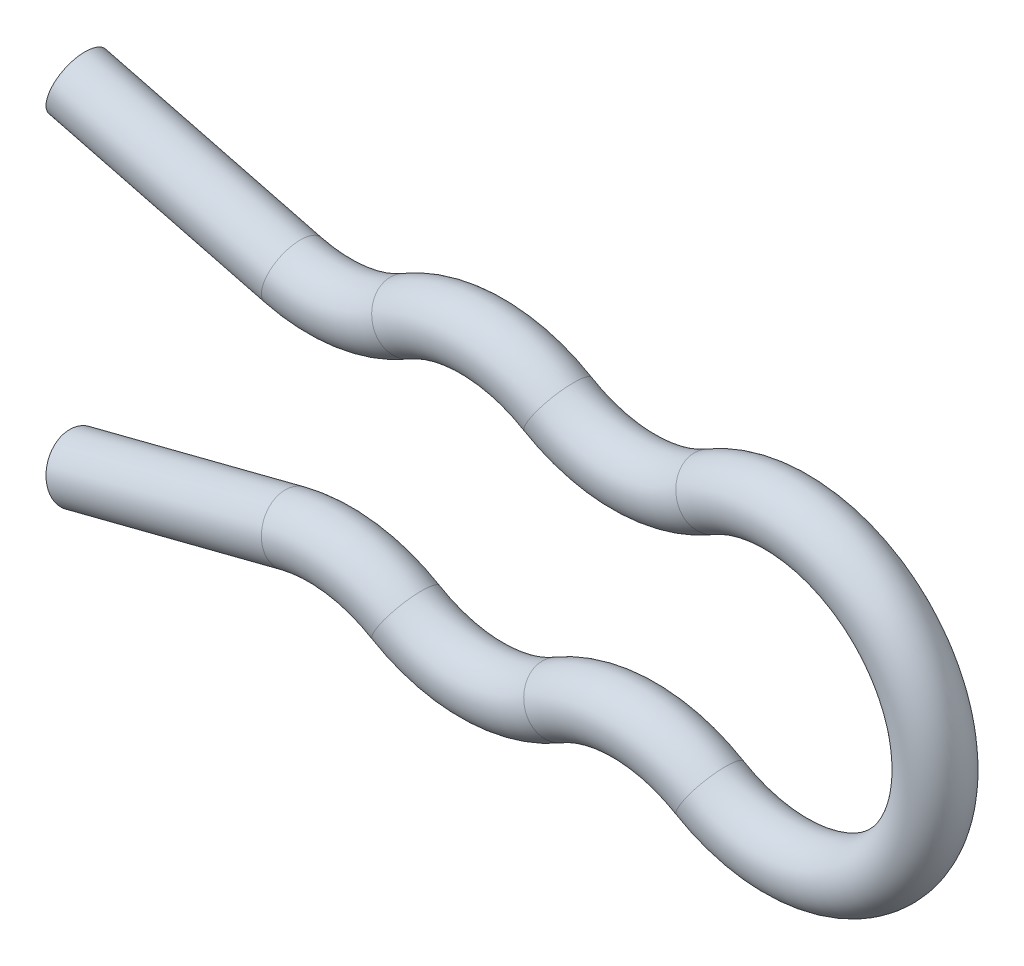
from build123d import *

# Parameters (mm, degrees)
ESQUISSE2_R             = 0.5
ESQUISSE3_W             = 0.258909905
ESQUISSE3_H             = 6.700588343
ENL_V_MAT_EXTRU_1_DEPTH = 30


with BuildPart() as part:
    # Balayage1: sweep along a path in Esquisse1
    with BuildLine(Plane.XY) as balayage1_path:
        Line((-11.65, 2.75), (-8.109081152, 1.841179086))
        ThreePointArc((-8.109081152, 1.841179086), (-7.15304638, 1.788952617), (-6.25, 2.107130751))
        ThreePointArc((-6.25, 2.107130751), (-5, 2.45), (-3.75, 2.107130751))
        ThreePointArc((-3.75, 2.107130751), (-2.5, 1.764261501), (-1.25, 2.107130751))
        ThreePointArc((-1.25, 2.107130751), (1.212435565, 2.128966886), (2.45, 0))
    # Esquisse2 → Balayage1 (sweep)
    with BuildSketch(Plane(origin=(0, 0, 0), x_dir=(1, 0, 0), z_dir=(0, 1, 0))):
        with Locations((2.45, 0)):
            Circle(ESQUISSE2_R)
    balayage1 = sweep(path=balayage1_path.line)

    # Sym_trie1: Balayage1 across plane
    add(balayage1.mirror(Plane(origin=(2.45, 0, 0), x_dir=(0, 0, 1), z_dir=(0, 1, 0))))

    # Esquisse3 → Enl_v. mat.-Extru.1 (cut, symmetric)
    with BuildSketch(Plane(origin=(0, 0, 0), x_dir=(0, 0, -1), z_dir=(1, 0, 0))):
        with Locations((0.628454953, -0.036247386)):
            Rectangle(ESQUISSE3_W, ESQUISSE3_H)
    extrude(amount=ENL_V_MAT_EXTRU_1_DEPTH, both=True, mode=Mode.SUBTRACT)


solid = part.part
